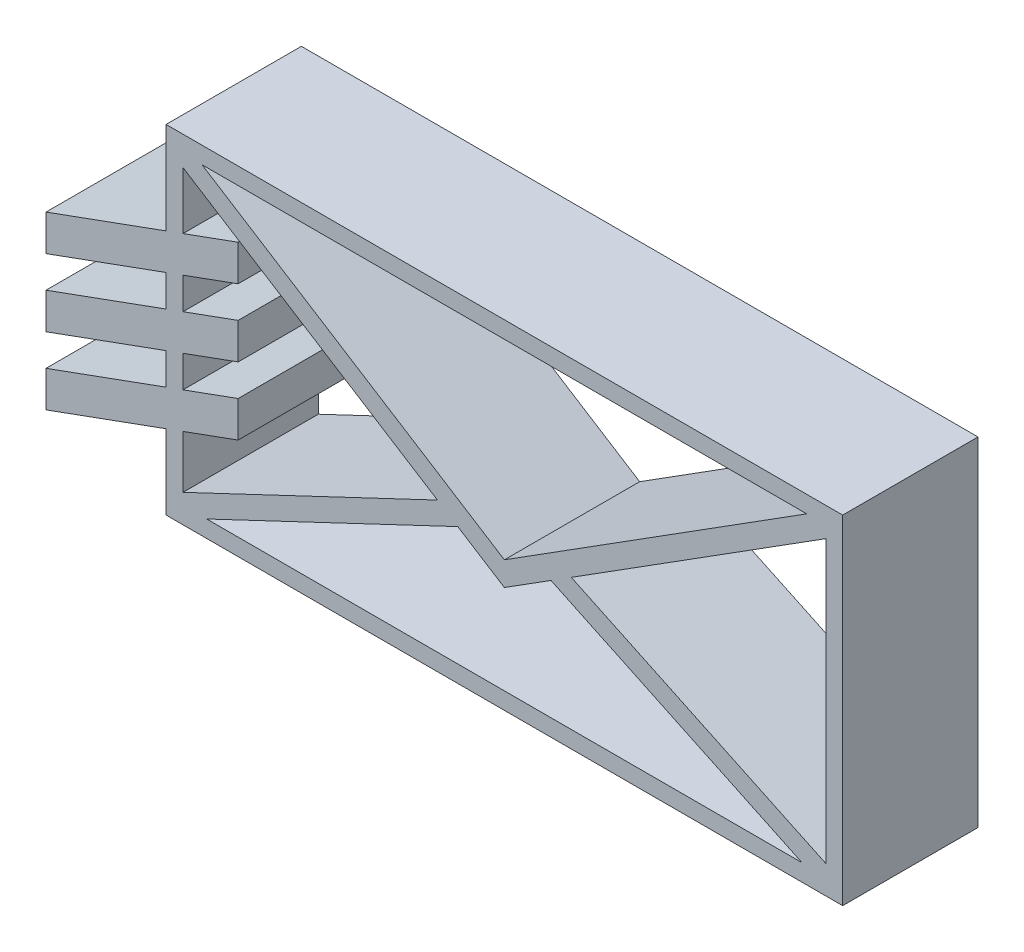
from build123d import *

# Parameters (mm, degrees)
SKIZZE1_W               = 10
SKIZZE1_H               = 5
SKIZZE1_W_2             = 9.5
SKIZZE1_H_2             = 4.5
LINEAR_AUSTRAGEN1_DEPTH = 2
LINEAR_AUSTRAGEN2_DEPTH = 2
LINEAR_AUSTRAGEN3_DEPTH = 2
LINEARES_MUSTER1_COUNT  = 3
LINEARES_MUSTER1_PITCH  = 1


with BuildPart() as part:
    # Skizze1 → Linear austragen1 (new body)
    with BuildSketch(Plane.XY):
        Rectangle(SKIZZE1_W, SKIZZE1_H)
        Rectangle(SKIZZE1_W_2, SKIZZE1_H_2, mode=Mode.SUBTRACT)
    extrude(amount=LINEAR_AUSTRAGEN1_DEPTH)

    # Skizze2 → Linear austragen2 (add)
    with BuildSketch(Plane.XY.offset(2)):
        Polygon((0, -0.927412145), (0.688917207, -0.492306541), (4.399603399, -2.25), (4.75, -2.25), (4.75, -2.084022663), (0.989257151, -0.302618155), (4.75, 2.072587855), (4.75, 2.25), (4.469097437, 2.25), (0, -0.572587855), (-4.469097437, 2.25), (-4.75, 2.25), (-4.75, 2.072587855), (-0.989257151, -0.302618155), (-4.75, -2.084022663), (-4.75, -2.25), (-4.399603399, -2.25), (-0.688917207, -0.492306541), align=None)
    extrude(amount=-LINEAR_AUSTRAGEN2_DEPTH)

    # Skizze3 → Linear austragen3 (add)
    with BuildSketch(Plane.XY.offset(2)):
        Polygon((-6.774681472, -2.041113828), (-3.93496597, -1.007541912), (-3.93496597, -0.475453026), (-6.774681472, -1.509024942), align=None)
    linear_austragen3 = extrude(amount=-LINEAR_AUSTRAGEN3_DEPTH)

    # Lineares Muster1: Linear austragen3 ×3
    with Locations(*[(0, i * LINEARES_MUSTER1_PITCH, 0) for i in range(1, LINEARES_MUSTER1_COUNT)]):
        add(linear_austragen3)


solid = part.part
